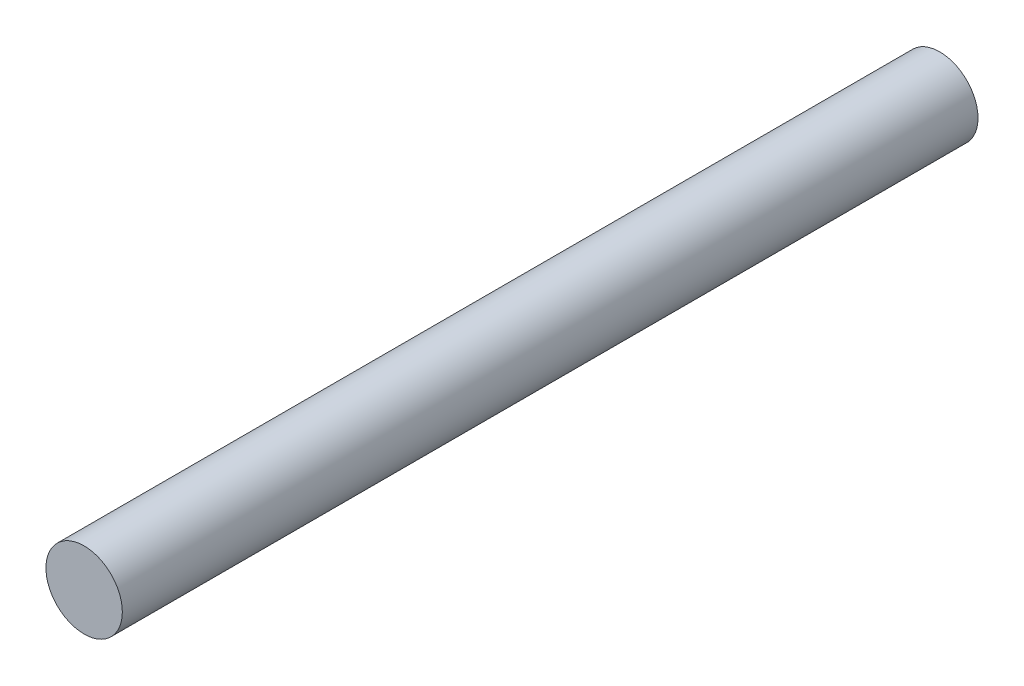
from build123d import *

# Parameters (mm, degrees)
SKETCH_1_R      = 5
EXTRUDE_1_DEPTH = 112


with BuildPart() as part:
    # Sketch 1 → Extrude 1 (new body)
    with BuildSketch(Plane.XY):
        Circle(SKETCH_1_R)
    extrude(amount=EXTRUDE_1_DEPTH)


solid = part.part
